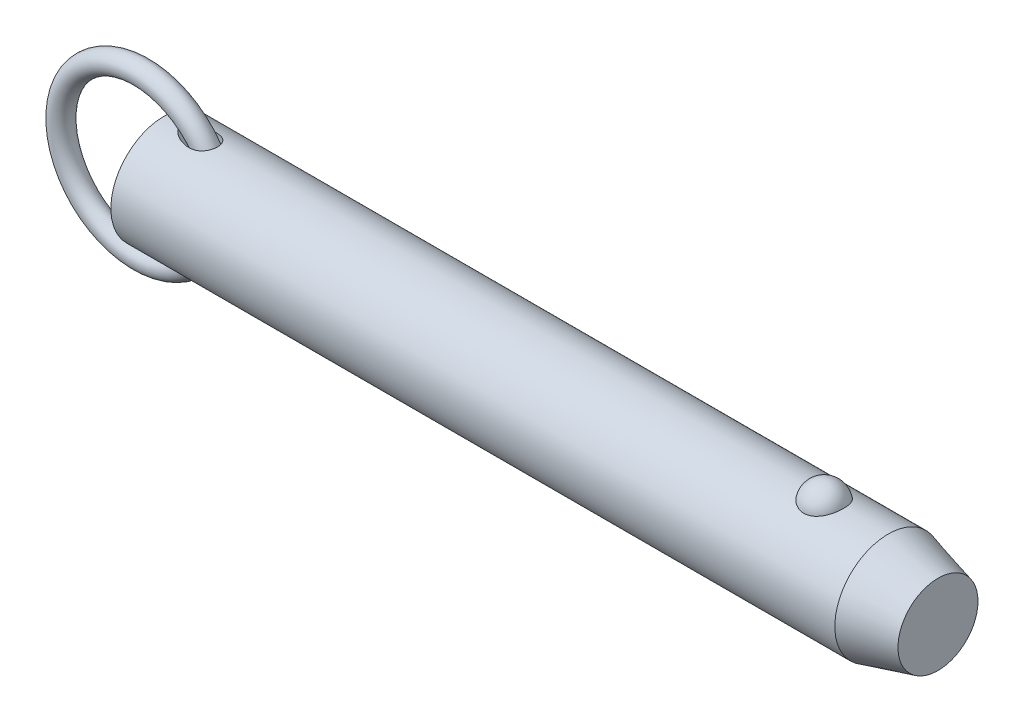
ISO-10303-21;
HEADER;
FILE_DESCRIPTION(('STEP AP214'),'2;1');
FILE_NAME('part.step','',(''),(''),'','','');
FILE_SCHEMA(('AUTOMOTIVE_DESIGN { 1 0 10303 214 1 1 1 1 }'));
ENDSEC;
DATA;
#1=APPLICATION_CONTEXT('core data for automotive mechanical design processes');
#2=APPLICATION_PROTOCOL_DEFINITION('international standard','automotive_design',2000,#1);
#3=PRODUCT_CONTEXT('',#1,'mechanical');
#4=PRODUCT('Part','Part','',(#3));
#5=PRODUCT_RELATED_PRODUCT_CATEGORY('part','',(#4));
#6=PRODUCT_DEFINITION_FORMATION('','',#4);
#7=PRODUCT_DEFINITION_CONTEXT('part definition',#1,'design');
#8=PRODUCT_DEFINITION('design','',#6,#7);
#9=PRODUCT_DEFINITION_SHAPE('','',#8);
#10=(LENGTH_UNIT() NAMED_UNIT(*) SI_UNIT(.MILLI.,.METRE.));
#11=(NAMED_UNIT(*) PLANE_ANGLE_UNIT() SI_UNIT($,.RADIAN.));
#12=(NAMED_UNIT(*) SI_UNIT($,.STERADIAN.) SOLID_ANGLE_UNIT());
#13=UNCERTAINTY_MEASURE_WITH_UNIT(LENGTH_MEASURE(1.E-05),#10,'distance_accuracy_value','');
#14=(GEOMETRIC_REPRESENTATION_CONTEXT(3) GLOBAL_UNCERTAINTY_ASSIGNED_CONTEXT((#13)) GLOBAL_UNIT_ASSIGNED_CONTEXT((#10,
#11,#12)) REPRESENTATION_CONTEXT('',''));
#15=CARTESIAN_POINT('',(0.,0.,0.));
#16=DIRECTION('',(0.,0.,1.));
#17=DIRECTION('',(1.,0.,0.));
#18=AXIS2_PLACEMENT_3D('',#15,#16,#17);
#19=CARTESIAN_POINT('',(-5.53898640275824,0.,0.));
#20=DIRECTION('',(0.,0.,1.));
#21=DIRECTION('',(1.,0.,0.));
#22=AXIS2_PLACEMENT_3D('',#19,#20,#21);
#23=TOROIDAL_SURFACE('',#22,19.05,2.54);
#24=CARTESIAN_POINT('',(16.0510135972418,0.,0.));
#25=VERTEX_POINT('',#24);
#26=VERTEX_LOOP('',#25);
#27=FACE_BOUND('',#26,.T.);
#28=ADVANCED_FACE('P0_F12',(#27),#23,.T.);
#29=CLOSED_SHELL('',(#28));
#30=MANIFOLD_SOLID_BREP('P0_B1',#29);
#31=CARTESIAN_POINT('',(0.,0.,0.));
#32=DIRECTION('',(1.,0.,0.));
#33=DIRECTION('',(0.,0.,-1.));
#34=AXIS2_PLACEMENT_3D('',#31,#32,#33);
#35=CYLINDRICAL_SURFACE('',#34,12.7);
#36=CARTESIAN_POINT('',(172.300738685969,0.,0.));
#37=DIRECTION('',(1.,0.,0.));
#38=DIRECTION('',(0.,0.,-1.));
#39=AXIS2_PLACEMENT_3D('',#36,#37,#38);
#40=CIRCLE('',#39,12.7);
#41=CARTESIAN_POINT('',(172.300738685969,0.,-12.7));
#42=VERTEX_POINT('',#41);
#43=EDGE_CURVE('P1_E89',#42,#42,#40,.T.);
#44=ORIENTED_EDGE('',*,*,#43,.F.);
#45=EDGE_LOOP('',(#44));
#46=FACE_BOUND('',#45,.T.);
#47=CARTESIAN_POINT('',(0.,0.,0.));
#48=DIRECTION('',(1.,0.,0.));
#49=DIRECTION('',(0.,0.,-1.));
#50=AXIS2_PLACEMENT_3D('',#47,#48,#49);
#51=CIRCLE('',#50,12.7);
#52=CARTESIAN_POINT('',(0.,0.,-12.7));
#53=VERTEX_POINT('',#52);
#54=EDGE_CURVE('P1_E52',#53,#53,#51,.T.);
#55=ORIENTED_EDGE('',*,*,#54,.T.);
#56=EDGE_LOOP('',(#55));
#57=FACE_BOUND('',#56,.T.);
#58=CARTESIAN_POINT('',(157.060042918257,11.7500437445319,4.81938502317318));
#59=CARTESIAN_POINT('',(156.935088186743,11.7500430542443,4.81938571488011));
#60=CARTESIAN_POINT('',(156.810144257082,11.7520975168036,4.81438658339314));
#61=CARTESIAN_POINT('',(156.561142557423,11.760253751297,4.79442904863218));
#62=CARTESIAN_POINT('',(156.437085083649,11.7663568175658,4.77946746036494));
#63=CARTESIAN_POINT('',(156.190901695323,11.7824262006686,4.7397141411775));
#64=CARTESIAN_POINT('',(156.068774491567,11.7923898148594,4.71492928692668));
#65=CARTESIAN_POINT('',(155.827187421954,11.8158938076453,4.65571340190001));
#66=CARTESIAN_POINT('',(155.70772859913,11.8294355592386,4.6212786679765));
#67=CARTESIAN_POINT('',(155.472557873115,11.8596812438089,4.54309502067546));
#68=CARTESIAN_POINT('',(155.356839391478,11.8763792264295,4.49936361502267));
#69=CARTESIAN_POINT('',(155.129653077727,11.9124878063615,4.40287235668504));
#70=CARTESIAN_POINT('',(155.018186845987,11.9318994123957,4.35010914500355));
#71=CARTESIAN_POINT('',(154.691278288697,11.9934256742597,4.17881316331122));
#72=CARTESIAN_POINT('',(154.483127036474,12.038858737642,4.04720756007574));
#73=CARTESIAN_POINT('',(154.085850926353,12.1352173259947,3.748564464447));
#74=CARTESIAN_POINT('',(153.897443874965,12.1862630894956,3.58061821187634));
#75=CARTESIAN_POINT('',(153.550521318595,12.2875163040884,3.21600758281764));
#76=CARTESIAN_POINT('',(153.392011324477,12.3377235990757,3.0193379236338));
#77=CARTESIAN_POINT('',(153.10168878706,12.4344923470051,2.592916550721));
#78=CARTESIAN_POINT('',(152.971376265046,12.4807925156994,2.36208286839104));
#79=CARTESIAN_POINT('',(152.749407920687,12.5623454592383,1.88070399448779));
#80=CARTESIAN_POINT('',(152.657755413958,12.5975972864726,1.63015711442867));
#81=CARTESIAN_POINT('',(152.514046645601,12.6538414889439,1.1129886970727));
#82=CARTESIAN_POINT('',(152.462499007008,12.6746503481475,0.846205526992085));
#83=CARTESIAN_POINT('',(152.401977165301,12.699153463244,0.307085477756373));
#84=CARTESIAN_POINT('',(152.393001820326,12.7028481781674,0.0347487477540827));
#85=CARTESIAN_POINT('',(152.417731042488,12.6927785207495,-0.506073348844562));
#86=CARTESIAN_POINT('',(152.451189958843,12.6791146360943,-0.774571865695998));
#87=CARTESIAN_POINT('',(152.559687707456,12.635882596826,-1.30170246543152));
#88=CARTESIAN_POINT('',(152.63472729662,12.606314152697,-1.56033436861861));
#89=CARTESIAN_POINT('',(152.82500006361,12.5342328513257,-2.0608389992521));
#90=CARTESIAN_POINT('',(152.940287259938,12.4917026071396,-2.30268867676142));
#91=CARTESIAN_POINT('',(153.208704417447,12.3981123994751,-2.76259600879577));
#92=CARTESIAN_POINT('',(153.361837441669,12.3470517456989,-2.98065173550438));
#93=CARTESIAN_POINT('',(153.703507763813,12.2416045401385,-3.38786328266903));
#94=CARTESIAN_POINT('',(153.892201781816,12.1872040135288,-3.57688418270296));
#95=CARTESIAN_POINT('',(154.300239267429,12.0814086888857,-3.91941073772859));
#96=CARTESIAN_POINT('',(154.519580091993,12.0300136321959,-4.07291945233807));
#97=CARTESIAN_POINT('',(154.978375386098,11.9373542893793,-4.33691289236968));
#98=CARTESIAN_POINT('',(155.217304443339,11.8958982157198,-4.44824125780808));
#99=CARTESIAN_POINT('',(155.71243761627,11.8268116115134,-4.62881985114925));
#100=CARTESIAN_POINT('',(155.968635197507,11.7991758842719,-4.69808589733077));
#101=CARTESIAN_POINT('',(156.477164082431,11.7622209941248,-4.78983181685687));
#102=CARTESIAN_POINT('',(156.729041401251,11.7520502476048,-4.81449025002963));
#103=CARTESIAN_POINT('',(157.233573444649,11.7485796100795,-4.82295735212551));
#104=CARTESIAN_POINT('',(157.486228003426,11.7552763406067,-4.80677420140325));
#105=CARTESIAN_POINT('',(157.976834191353,11.7842584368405,-4.73525430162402));
#106=CARTESIAN_POINT('',(158.214998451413,11.8060486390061,-4.68116061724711));
#107=CARTESIAN_POINT('',(158.678489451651,11.8622750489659,-4.53678133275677));
#108=CARTESIAN_POINT('',(158.903815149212,11.8967122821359,-4.44649279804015));
#109=CARTESIAN_POINT('',(159.340801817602,11.9754603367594,-4.2298761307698));
#110=CARTESIAN_POINT('',(159.552057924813,12.0199699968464,-4.10280539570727));
#111=CARTESIAN_POINT('',(159.950601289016,12.1138028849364,-3.81685409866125));
#112=CARTESIAN_POINT('',(160.137883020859,12.163127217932,-3.65796622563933));
#113=CARTESIAN_POINT('',(160.493350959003,12.2642343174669,-3.30364864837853));
#114=CARTESIAN_POINT('',(160.660111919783,12.3160165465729,-3.10678783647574));
#115=CARTESIAN_POINT('',(160.959579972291,12.4142566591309,-2.68748409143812));
#116=CARTESIAN_POINT('',(161.092280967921,12.4607135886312,-2.4650365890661));
#117=CARTESIAN_POINT('',(161.324691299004,12.5450236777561,-1.9928951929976));
#118=CARTESIAN_POINT('',(161.423215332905,12.5825557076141,-1.74255918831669));
#119=CARTESIAN_POINT('',(161.579227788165,12.6431720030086,-1.22773734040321));
#120=CARTESIAN_POINT('',(161.636715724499,12.6662560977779,-0.963251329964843));
#121=CARTESIAN_POINT('',(161.709544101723,12.6956486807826,-0.427355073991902));
#122=CARTESIAN_POINT('',(161.724837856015,12.7019385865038,-0.155937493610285));
#123=CARTESIAN_POINT('',(161.712779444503,12.6970201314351,0.38592890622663));
#124=CARTESIAN_POINT('',(161.68542805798,12.6858120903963,0.656377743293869));
#125=CARTESIAN_POINT('',(161.613060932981,12.6568455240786,1.05454017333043));
#126=CARTESIAN_POINT('',(161.583796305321,12.6451962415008,1.18577850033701));
#127=CARTESIAN_POINT('',(161.515022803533,12.6181819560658,1.44513808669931));
#128=CARTESIAN_POINT('',(161.475517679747,12.6028183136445,1.57326046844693));
#129=CARTESIAN_POINT('',(161.386439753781,12.5687547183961,1.82554978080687));
#130=CARTESIAN_POINT('',(161.336862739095,12.5500533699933,1.94971503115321));
#131=CARTESIAN_POINT('',(161.22792115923,12.5098093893,2.19314370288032));
#132=CARTESIAN_POINT('',(161.168560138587,12.4882677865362,2.31240887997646));
#133=CARTESIAN_POINT('',(161.03997128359,12.4427679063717,2.5459303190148));
#134=CARTESIAN_POINT('',(160.970688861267,12.4187964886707,2.66015396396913));
#135=CARTESIAN_POINT('',(160.822903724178,12.3691892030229,2.88202659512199));
#136=CARTESIAN_POINT('',(160.744404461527,12.3435539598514,2.98967802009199));
#137=CARTESIAN_POINT('',(160.578550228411,12.2912955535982,3.19774385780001));
#138=CARTESIAN_POINT('',(160.491191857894,12.2646720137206,3.29815546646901));
#139=CARTESIAN_POINT('',(160.308161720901,12.2111945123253,3.49095035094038));
#140=CARTESIAN_POINT('',(160.212493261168,12.1843406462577,3.58333679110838));
#141=CARTESIAN_POINT('',(160.013627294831,12.1312249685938,3.75922876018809));
#142=CARTESIAN_POINT('',(159.910450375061,12.104961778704,3.84275713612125));
#143=CARTESIAN_POINT('',(159.69701336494,12.0537284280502,4.00056406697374));
#144=CARTESIAN_POINT('',(159.586756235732,12.028757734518,4.07484645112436));
#145=CARTESIAN_POINT('',(159.359755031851,11.9808306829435,4.21367959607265));
#146=CARTESIAN_POINT('',(159.243006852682,11.9578756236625,4.27822410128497));
#147=CARTESIAN_POINT('',(159.00394258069,11.9147184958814,4.39698483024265));
#148=CARTESIAN_POINT('',(158.881628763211,11.894515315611,4.45120522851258));
#149=CARTESIAN_POINT('',(158.622952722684,11.8561129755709,4.55255353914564));
#150=CARTESIAN_POINT('',(158.486223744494,11.8381764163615,4.59884858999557));
#151=CARTESIAN_POINT('',(158.208608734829,11.8069093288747,4.67853897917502));
#152=CARTESIAN_POINT('',(158.067724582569,11.7935767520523,4.71194005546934));
#153=CARTESIAN_POINT('',(157.78309446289,11.7720277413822,4.76552188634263));
#154=CARTESIAN_POINT('',(157.639348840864,11.7638106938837,4.78570422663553));
#155=CARTESIAN_POINT('',(157.350411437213,11.7528195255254,4.81263433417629));
#156=CARTESIAN_POINT('',(157.205219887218,11.7500445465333,4.81938421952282));
#157=CARTESIAN_POINT('',(157.060042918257,11.7500437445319,4.81938502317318));
#158=B_SPLINE_CURVE_WITH_KNOTS('',3,(#58,#59,#60,#61,#62,#63,#64,#65,#66,#67,#68,#69,#70,#71,
#72,#73,#74,#75,#76,#77,#78,#79,#80,#81,#82,#83,#84,#85,#86,#87,#88,#89,#90,#91,#92,#93,#94,#95,
#96,#97,#98,#99,#100,#101,#102,#103,#104,#105,#106,#107,#108,#109,#110,#111,#112,#113,#114,#115,
#116,#117,#118,#119,#120,#121,#122,#123,#124,#125,#126,#127,#128,#129,#130,#131,#132,#133,#134,
#135,#136,#137,#138,#139,#140,#141,#142,#143,#144,#145,#146,#147,#148,#149,#150,#151,#152,#153,
#154,#155,#156,#157),.UNSPECIFIED.,.T.,.F.,(4,2,2,2,2,2,2,2,2,2,2,2,2,2,2,2,2,2,2,2,2,2,2,2,2,2,
2,2,2,2,2,2,2,2,2,2,2,2,2,2,2,2,2,2,2,2,2,2,2,4),(0.,0.374729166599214,0.749578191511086,
1.12416526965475,1.49889629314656,1.87292776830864,2.24709865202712,2.99481328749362,
3.76399449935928,4.53331735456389,5.3368391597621,6.14042986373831,6.95405296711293,
7.76765424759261,8.57656703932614,9.38549455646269,10.1955119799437,11.0055949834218,
11.8193353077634,12.6330054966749,13.4294141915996,14.2255231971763,14.9815786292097,
15.7374826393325,16.4696948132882,17.2019663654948,17.9501979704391,18.6986017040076,
19.4844704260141,20.2704797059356,21.0815215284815,21.8925729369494,22.7045213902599,
23.5164550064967,23.9209608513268,24.3253187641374,24.7298461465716,25.1342272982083,
25.54092555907,25.9474719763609,26.3541750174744,26.7607169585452,27.166183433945,
27.5714814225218,27.9770386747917,28.3824315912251,28.8181206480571,29.2536155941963,
29.6890582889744,30.1244323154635),.UNSPECIFIED.);
#159=CARTESIAN_POINT('',(157.060042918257,11.7500437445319,4.81938502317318));
#160=VERTEX_POINT('',#159);
#161=EDGE_CURVE('P1_E80',#160,#160,#158,.T.);
#162=ORIENTED_EDGE('',*,*,#161,.T.);
#163=EDGE_LOOP('',(#162));
#164=FACE_BOUND('',#163,.T.);
#165=CARTESIAN_POINT('',(-5.53898640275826,0.,0.));
#166=DIRECTION('',(0.796400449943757,-0.604769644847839,0.));
#167=DIRECTION('',(0.604769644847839,0.796400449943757,0.));
#168=AXIS2_PLACEMENT_3D('',#165,#166,#167);
#169=ELLIPSE('',#168,15.9467514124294,12.7);
#170=CARTESIAN_POINT('',(4.09482149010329,12.6864319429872,0.586893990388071));
#171=VERTEX_POINT('',#170);
#172=CARTESIAN_POINT('',(4.09482149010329,12.6864319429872,-0.586893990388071));
#173=VERTEX_POINT('',#172);
#174=EDGE_CURVE('P1_E47',#171,#173,#169,.F.);
#175=ORIENTED_EDGE('',*,*,#174,.T.);
#176=CARTESIAN_POINT('',(4.06153170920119,12.6905758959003,-0.48916605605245));
#177=CARTESIAN_POINT('',(4.0811137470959,12.6881366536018,-0.552489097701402));
#178=CARTESIAN_POINT('',(4.1041785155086,12.6852663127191,-0.614604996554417));
#179=CARTESIAN_POINT('',(4.15628434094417,12.6787965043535,-0.736067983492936));
#180=CARTESIAN_POINT('',(4.18531032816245,12.6751988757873,-0.795421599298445));
#181=CARTESIAN_POINT('',(4.27911159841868,12.6636052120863,-0.967590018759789));
#182=CARTESIAN_POINT('',(4.35123408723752,12.654730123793,-1.07635920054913));
#183=CARTESIAN_POINT('',(4.49106800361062,12.6376715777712,-1.25922957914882));
#184=CARTESIAN_POINT('',(4.55601066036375,12.6297947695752,-1.33556751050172));
#185=CARTESIAN_POINT('',(4.692236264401,12.6134116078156,-1.4823274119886));
#186=CARTESIAN_POINT('',(4.76352147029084,12.6049050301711,-1.55274725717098));
#187=CARTESIAN_POINT('',(4.91163946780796,12.587417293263,-1.68868704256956));
#188=CARTESIAN_POINT('',(4.98851399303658,12.5784327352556,-1.75416062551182));
#189=CARTESIAN_POINT('',(5.14630057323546,12.560235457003,-1.88003275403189));
#190=CARTESIAN_POINT('',(5.22721398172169,12.5510226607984,-1.94042957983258));
#191=CARTESIAN_POINT('',(5.45368877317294,12.5256514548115,-2.09966332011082));
#192=CARTESIAN_POINT('',(5.60261616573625,12.5094182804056,-2.19371988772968));
#193=CARTESIAN_POINT('',(5.90795545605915,12.4774211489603,-2.36893890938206));
#194=CARTESIAN_POINT('',(6.0643723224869,12.4616575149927,-2.45009264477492));
#195=CARTESIAN_POINT('',(6.38306132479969,12.431227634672,-2.6000824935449));
#196=CARTESIAN_POINT('',(6.54533237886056,12.4165611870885,-2.66892086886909));
#197=CARTESIAN_POINT('',(6.87462618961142,12.3889351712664,-2.79435199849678));
#198=CARTESIAN_POINT('',(7.04164773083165,12.3759751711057,-2.85094785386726));
#199=CARTESIAN_POINT('',(7.38726647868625,12.3518460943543,-2.95377962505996));
#200=CARTESIAN_POINT('',(7.56604577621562,12.3407843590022,-2.99943209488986));
#201=CARTESIAN_POINT('',(7.92698692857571,12.3219309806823,-3.07596683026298));
#202=CARTESIAN_POINT('',(8.10914972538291,12.314140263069,-3.10684491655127));
#203=CARTESIAN_POINT('',(8.47511457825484,12.3025918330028,-3.15226850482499));
#204=CARTESIAN_POINT('',(8.6589097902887,12.2988216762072,-3.16686440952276));
#205=CARTESIAN_POINT('',(9.02696087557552,12.2959421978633,-3.17802250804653));
#206=CARTESIAN_POINT('',(9.21121628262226,12.2968292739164,-3.17459864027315));
#207=CARTESIAN_POINT('',(9.61636263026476,12.3045198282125,-3.14471110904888));
#208=CARTESIAN_POINT('',(9.83695552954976,12.3125080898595,-3.11363232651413));
#209=CARTESIAN_POINT('',(10.1619126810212,12.3303028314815,-3.04206574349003));
#210=CARTESIAN_POINT('',(10.2692747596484,12.3372061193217,-3.01403983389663));
#211=CARTESIAN_POINT('',(10.4811758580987,12.3528538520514,-2.94925947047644));
#212=CARTESIAN_POINT('',(10.5857162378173,12.361597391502,-2.91250930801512));
#213=CARTESIAN_POINT('',(10.792132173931,12.3808585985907,-2.8295174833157));
#214=CARTESIAN_POINT('',(10.8939665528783,12.3913944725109,-2.78317723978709));
#215=CARTESIAN_POINT('',(11.092611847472,12.4138762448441,-2.68112002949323));
#216=CARTESIAN_POINT('',(11.1894254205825,12.4258213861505,-2.62540809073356));
#217=CARTESIAN_POINT('',(11.3768740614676,12.4507225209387,-2.50465655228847));
#218=CARTESIAN_POINT('',(11.4675115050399,12.4636781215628,-2.43962056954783));
#219=CARTESIAN_POINT('',(11.6414572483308,12.4901070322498,-2.30048560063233));
#220=CARTESIAN_POINT('',(11.7247669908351,12.5035802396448,-2.22638840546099));
#221=CARTESIAN_POINT('',(11.8713131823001,12.5285000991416,-2.08117367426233));
#222=CARTESIAN_POINT('',(11.9357009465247,12.5399538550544,-2.01121596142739));
#223=CARTESIAN_POINT('',(12.0576805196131,12.5624496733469,-1.86555293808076));
#224=CARTESIAN_POINT('',(12.1152732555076,12.5734917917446,-1.7898484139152));
#225=CARTESIAN_POINT('',(12.223073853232,12.5947858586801,-1.63327883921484));
#226=CARTESIAN_POINT('',(12.2732844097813,12.6050380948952,-1.5524156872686));
#227=CARTESIAN_POINT('',(12.3658430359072,12.6243983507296,-1.38621267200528));
#228=CARTESIAN_POINT('',(12.408191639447,12.6335064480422,-1.30087311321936));
#229=CARTESIAN_POINT('',(12.5150098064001,12.6569076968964,-1.05702619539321));
#230=CARTESIAN_POINT('',(12.5703399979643,12.6695746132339,-0.894232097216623));
#231=CARTESIAN_POINT('',(12.6526225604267,12.6886816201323,-0.561391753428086));
#232=CARTESIAN_POINT('',(12.6795825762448,12.6951233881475,-0.391347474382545));
#233=CARTESIAN_POINT('',(12.7041016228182,12.7009766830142,-0.0537636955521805));
#234=CARTESIAN_POINT('',(12.7024538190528,12.7005778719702,0.113714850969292));
#235=CARTESIAN_POINT('',(12.6717240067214,12.6932548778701,0.445979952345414));
#236=CARTESIAN_POINT('',(12.6426435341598,12.6863310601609,0.610766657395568));
#237=CARTESIAN_POINT('',(12.5579769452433,12.6667465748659,0.932429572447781));
#238=CARTESIAN_POINT('',(12.5024793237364,12.6541050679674,1.08933027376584));
#239=CARTESIAN_POINT('',(12.3665691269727,12.6244558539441,1.39146752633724));
#240=CARTESIAN_POINT('',(12.2861577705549,12.6074483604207,1.53670464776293));
#241=CARTESIAN_POINT('',(12.1018203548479,12.5706804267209,1.81319588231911));
#242=CARTESIAN_POINT('',(11.9976588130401,12.5508932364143,1.94428915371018));
#243=CARTESIAN_POINT('',(11.7695265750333,12.5107540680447,2.18776051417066));
#244=CARTESIAN_POINT('',(11.6455540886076,12.4904020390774,2.3001369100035));
#245=CARTESIAN_POINT('',(11.3759347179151,12.4502278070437,2.50870972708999));
#246=CARTESIAN_POINT('',(11.2295880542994,12.4304654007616,2.60400962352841));
#247=CARTESIAN_POINT('',(10.9239803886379,12.3941696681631,2.77162929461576));
#248=CARTESIAN_POINT('',(10.7647152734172,12.3776373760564,2.84394171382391));
#249=CARTESIAN_POINT('',(10.4192039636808,12.3473062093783,2.97303525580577));
#250=CARTESIAN_POINT('',(10.2319332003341,12.3340204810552,3.027171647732));
#251=CARTESIAN_POINT('',(9.85152982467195,12.3134301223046,3.10986173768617));
#252=CARTESIAN_POINT('',(9.65839336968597,12.3061295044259,3.13839827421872));
#253=CARTESIAN_POINT('',(9.31022514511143,12.2982822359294,3.16897517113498));
#254=CARTESIAN_POINT('',(9.15555718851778,12.2966525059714,3.17526894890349));
#255=CARTESIAN_POINT('',(8.84618945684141,12.2967963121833,3.17471335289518));
#256=CARTESIAN_POINT('',(8.6914897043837,12.2985715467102,3.16785742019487));
#257=CARTESIAN_POINT('',(8.38280471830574,12.3051648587,3.14214692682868));
#258=CARTESIAN_POINT('',(8.22882218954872,12.3099904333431,3.12326280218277));
#259=CARTESIAN_POINT('',(7.92276070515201,12.3222644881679,3.07448013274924));
#260=CARTESIAN_POINT('',(7.77068148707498,12.3297126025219,3.04458312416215));
#261=CARTESIAN_POINT('',(7.46452663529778,12.3470493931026,2.97350781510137));
#262=CARTESIAN_POINT('',(7.31052714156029,12.3570043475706,2.93201910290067));
#263=CARTESIAN_POINT('',(7.00579083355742,12.3787609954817,2.83876185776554));
#264=CARTESIAN_POINT('',(6.85505451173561,12.3905629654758,2.7869917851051));
#265=CARTESIAN_POINT('',(6.55781208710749,12.415528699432,2.67357744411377));
#266=CARTESIAN_POINT('',(6.41129783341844,12.4286895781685,2.61195394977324));
#267=CARTESIAN_POINT('',(6.12302950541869,12.4559398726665,2.47874512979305));
#268=CARTESIAN_POINT('',(5.98127390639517,12.4700289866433,2.40716303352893));
#269=CARTESIAN_POINT('',(5.67073126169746,12.5020754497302,2.23550426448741));
#270=CARTESIAN_POINT('',(5.50343839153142,12.5201625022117,2.13268685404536));
#271=CARTESIAN_POINT('',(5.26147616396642,12.5471537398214,1.96522579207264));
#272=CARTESIAN_POINT('',(5.18224299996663,12.5561365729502,1.90713440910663));
#273=CARTESIAN_POINT('',(5.0274647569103,12.5739122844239,1.78618989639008));
#274=CARTESIAN_POINT('',(4.95191912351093,12.5827051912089,1.72333748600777));
#275=CARTESIAN_POINT('',(4.81787163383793,12.598469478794,1.60360864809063));
#276=CARTESIAN_POINT('',(4.75865966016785,12.6054958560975,1.54753994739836));
#277=CARTESIAN_POINT('',(4.64406285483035,12.6191906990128,1.43158546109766));
#278=CARTESIAN_POINT('',(4.58867926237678,12.6258590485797,1.37169845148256));
#279=CARTESIAN_POINT('',(4.43014912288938,12.6450546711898,1.18656670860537));
#280=CARTESIAN_POINT('',(4.33372726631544,12.6568788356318,1.05507993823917));
#281=CARTESIAN_POINT('',(4.21252055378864,12.6718304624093,0.848052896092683));
#282=CARTESIAN_POINT('',(4.17660155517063,12.6762773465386,0.779100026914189));
#283=CARTESIAN_POINT('',(4.11264979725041,12.6842122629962,0.637080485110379));
#284=CARTESIAN_POINT('',(4.08466792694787,12.6876941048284,0.563990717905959));
#285=CARTESIAN_POINT('',(4.06153170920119,12.6905758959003,0.489166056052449));
#286=B_SPLINE_CURVE_WITH_KNOTS('',3,(#176,#177,#178,#179,#180,#181,#182,#183,#184,#185,#186,
#187,#188,#189,#190,#191,#192,#193,#194,#195,#196,#197,#198,#199,#200,#201,#202,#203,#204,#205,
#206,#207,#208,#209,#210,#211,#212,#213,#214,#215,#216,#217,#218,#219,#220,#221,#222,#223,#224,
#225,#226,#227,#228,#229,#230,#231,#232,#233,#234,#235,#236,#237,#238,#239,#240,#241,#242,#243,
#244,#245,#246,#247,#248,#249,#250,#251,#252,#253,#254,#255,#256,#257,#258,#259,#260,#261,#262,
#263,#264,#265,#266,#267,#268,#269,#270,#271,#272,#273,#274,#275,#276,#277,#278,#279,#280,#281,
#282,#283,#284,#285),.UNSPECIFIED.,.F.,.F.,(4,2,2,2,2,2,2,2,2,2,2,2,2,2,2,2,2,2,2,2,2,2,2,2,2,2,
2,2,2,2,2,2,2,2,2,2,2,2,2,2,2,2,2,2,2,2,2,2,2,2,2,2,2,2,4),(0.,0.198708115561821,
0.39691995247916,0.787580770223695,1.08882492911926,1.3901767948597,1.69407136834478,
1.9980684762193,2.52793143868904,3.05815092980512,3.58827293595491,4.1182605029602,
4.67218806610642,5.22627222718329,5.77863637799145,6.33057333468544,6.99657211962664,
7.32977411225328,7.66281254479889,7.99946156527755,8.33593054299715,8.6722693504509,
9.00854178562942,9.29544181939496,9.58230266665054,9.8690585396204,10.155794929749,
10.670233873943,11.184534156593,11.6845985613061,12.1846349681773,12.6830079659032,
13.1813565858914,13.6848795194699,14.1884479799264,14.7135333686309,15.2387866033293,
15.8228373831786,16.4072794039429,16.8710810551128,17.3351141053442,17.8002921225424,
18.2654052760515,18.7444169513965,19.2235004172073,19.7015868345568,20.1795185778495,
20.7699825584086,21.0658110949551,21.361595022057,21.6069574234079,21.8523988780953,
22.3397467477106,22.5729183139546,22.8075527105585),.UNSPECIFIED.);
#287=EDGE_CURVE('P1_E51',#173,#171,#286,.T.);
#288=ORIENTED_EDGE('',*,*,#287,.T.);
#289=EDGE_LOOP('',(#175,#288));
#290=FACE_BOUND('',#289,.T.);
#291=CARTESIAN_POINT('',(-5.53898640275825,0.,0.));
#292=DIRECTION('',(-0.796400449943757,-0.604769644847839,0.));
#293=DIRECTION('',(0.604769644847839,-0.796400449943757,0.));
#294=AXIS2_PLACEMENT_3D('',#291,#292,#293);
#295=ELLIPSE('',#294,15.9467514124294,12.7);
#296=CARTESIAN_POINT('',(4.0948214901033,-12.6864319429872,0.586893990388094));
#297=VERTEX_POINT('',#296);
#298=CARTESIAN_POINT('',(4.0948214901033,-12.6864319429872,-0.586893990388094));
#299=VERTEX_POINT('',#298);
#300=EDGE_CURVE('P1_E28',#297,#299,#295,.F.);
#301=ORIENTED_EDGE('',*,*,#300,.F.);
#302=CARTESIAN_POINT('',(4.06153170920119,-12.6905758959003,0.489166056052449));
#303=CARTESIAN_POINT('',(4.08111374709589,-12.6881366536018,0.552489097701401));
#304=CARTESIAN_POINT('',(4.1041785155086,-12.6852663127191,0.614604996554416));
#305=CARTESIAN_POINT('',(4.15628434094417,-12.6787965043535,0.736067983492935));
#306=CARTESIAN_POINT('',(4.18531032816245,-12.6751988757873,0.795421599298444));
#307=CARTESIAN_POINT('',(4.27911159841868,-12.6636052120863,0.967590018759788));
#308=CARTESIAN_POINT('',(4.35123408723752,-12.654730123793,1.07635920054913));
#309=CARTESIAN_POINT('',(4.49106800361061,-12.6376715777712,1.25922957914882));
#310=CARTESIAN_POINT('',(4.55601066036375,-12.6297947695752,1.33556751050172));
#311=CARTESIAN_POINT('',(4.692236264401,-12.6134116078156,1.48232741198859));
#312=CARTESIAN_POINT('',(4.76352147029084,-12.6049050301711,1.55274725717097));
#313=CARTESIAN_POINT('',(4.91163946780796,-12.587417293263,1.68868704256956));
#314=CARTESIAN_POINT('',(4.98851399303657,-12.5784327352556,1.75416062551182));
#315=CARTESIAN_POINT('',(5.14630057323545,-12.560235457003,1.88003275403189));
#316=CARTESIAN_POINT('',(5.22721398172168,-12.5510226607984,1.94042957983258));
#317=CARTESIAN_POINT('',(5.45368877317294,-12.5256514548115,2.09966332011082));
#318=CARTESIAN_POINT('',(5.60261616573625,-12.5094182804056,2.19371988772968));
#319=CARTESIAN_POINT('',(5.90795545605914,-12.4774211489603,2.36893890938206));
#320=CARTESIAN_POINT('',(6.06437232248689,-12.4616575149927,2.45009264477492));
#321=CARTESIAN_POINT('',(6.38306132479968,-12.431227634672,2.6000824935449));
#322=CARTESIAN_POINT('',(6.54533237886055,-12.4165611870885,2.66892086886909));
#323=CARTESIAN_POINT('',(6.87462618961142,-12.3889351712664,2.79435199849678));
#324=CARTESIAN_POINT('',(7.04164773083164,-12.3759751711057,2.85094785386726));
#325=CARTESIAN_POINT('',(7.38726647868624,-12.3518460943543,2.95377962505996));
#326=CARTESIAN_POINT('',(7.56604577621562,-12.3407843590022,2.99943209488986));
#327=CARTESIAN_POINT('',(7.92698692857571,-12.3219309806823,3.07596683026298));
#328=CARTESIAN_POINT('',(8.1091497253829,-12.314140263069,3.10684491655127));
#329=CARTESIAN_POINT('',(8.47511457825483,-12.3025918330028,3.15226850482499));
#330=CARTESIAN_POINT('',(8.65890979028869,-12.2988216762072,3.16686440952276));
#331=CARTESIAN_POINT('',(9.02696087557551,-12.2959421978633,3.17802250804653));
#332=CARTESIAN_POINT('',(9.21121628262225,-12.2968292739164,3.17459864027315));
#333=CARTESIAN_POINT('',(9.61636263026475,-12.3045198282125,3.14471110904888));
#334=CARTESIAN_POINT('',(9.83695552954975,-12.3125080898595,3.11363232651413));
#335=CARTESIAN_POINT('',(10.1619126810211,-12.3303028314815,3.04206574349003));
#336=CARTESIAN_POINT('',(10.2692747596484,-12.3372061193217,3.01403983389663));
#337=CARTESIAN_POINT('',(10.4811758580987,-12.3528538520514,2.94925947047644));
#338=CARTESIAN_POINT('',(10.5857162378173,-12.361597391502,2.91250930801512));
#339=CARTESIAN_POINT('',(10.792132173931,-12.3808585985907,2.8295174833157));
#340=CARTESIAN_POINT('',(10.8939665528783,-12.3913944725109,2.78317723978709));
#341=CARTESIAN_POINT('',(11.092611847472,-12.4138762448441,2.68112002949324));
#342=CARTESIAN_POINT('',(11.1894254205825,-12.4258213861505,2.62540809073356));
#343=CARTESIAN_POINT('',(11.3768740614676,-12.4507225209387,2.50465655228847));
#344=CARTESIAN_POINT('',(11.4675115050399,-12.4636781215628,2.43962056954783));
#345=CARTESIAN_POINT('',(11.6414572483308,-12.4901070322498,2.30048560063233));
#346=CARTESIAN_POINT('',(11.7247669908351,-12.5035802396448,2.22638840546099));
#347=CARTESIAN_POINT('',(11.8713131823,-12.5285000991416,2.08117367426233));
#348=CARTESIAN_POINT('',(11.9357009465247,-12.5399538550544,2.01121596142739));
#349=CARTESIAN_POINT('',(12.0576805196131,-12.5624496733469,1.86555293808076));
#350=CARTESIAN_POINT('',(12.1152732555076,-12.5734917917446,1.7898484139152));
#351=CARTESIAN_POINT('',(12.223073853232,-12.5947858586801,1.63327883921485));
#352=CARTESIAN_POINT('',(12.2732844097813,-12.6050380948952,1.5524156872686));
#353=CARTESIAN_POINT('',(12.3658430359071,-12.6243983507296,1.38621267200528));
#354=CARTESIAN_POINT('',(12.408191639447,-12.6335064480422,1.30087311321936));
#355=CARTESIAN_POINT('',(12.5150098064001,-12.6569076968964,1.05702619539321));
#356=CARTESIAN_POINT('',(12.5703399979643,-12.6695746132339,0.894232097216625));
#357=CARTESIAN_POINT('',(12.6526225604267,-12.6886816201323,0.56139175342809));
#358=CARTESIAN_POINT('',(12.6795825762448,-12.6951233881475,0.39134747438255));
#359=CARTESIAN_POINT('',(12.7041016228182,-12.7009766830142,0.0537636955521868));
#360=CARTESIAN_POINT('',(12.7024538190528,-12.7005778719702,-0.113714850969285));
#361=CARTESIAN_POINT('',(12.6717240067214,-12.6932548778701,-0.445979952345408));
#362=CARTESIAN_POINT('',(12.6426435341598,-12.6863310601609,-0.610766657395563));
#363=CARTESIAN_POINT('',(12.5579769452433,-12.6667465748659,-0.932429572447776));
#364=CARTESIAN_POINT('',(12.5024793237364,-12.6541050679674,-1.08933027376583));
#365=CARTESIAN_POINT('',(12.3665691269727,-12.6244558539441,-1.39146752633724));
#366=CARTESIAN_POINT('',(12.2861577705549,-12.6074483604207,-1.53670464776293));
#367=CARTESIAN_POINT('',(12.1018203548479,-12.5706804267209,-1.81319588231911));
#368=CARTESIAN_POINT('',(11.9976588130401,-12.5508932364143,-1.94428915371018));
#369=CARTESIAN_POINT('',(11.7695265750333,-12.5107540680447,-2.18776051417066));
#370=CARTESIAN_POINT('',(11.6455540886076,-12.4904020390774,-2.3001369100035));
#371=CARTESIAN_POINT('',(11.3759347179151,-12.4502278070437,-2.50870972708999));
#372=CARTESIAN_POINT('',(11.2295880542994,-12.4304654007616,-2.60400962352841));
#373=CARTESIAN_POINT('',(10.9239803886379,-12.3941696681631,-2.77162929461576));
#374=CARTESIAN_POINT('',(10.7647152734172,-12.3776373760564,-2.84394171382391));
#375=CARTESIAN_POINT('',(10.4192039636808,-12.3473062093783,-2.97303525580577));
#376=CARTESIAN_POINT('',(10.2319332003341,-12.3340204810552,-3.027171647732));
#377=CARTESIAN_POINT('',(9.85152982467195,-12.3134301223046,-3.10986173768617));
#378=CARTESIAN_POINT('',(9.65839336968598,-12.3061295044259,-3.13839827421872));
#379=CARTESIAN_POINT('',(9.31022514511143,-12.2982822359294,-3.16897517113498));
#380=CARTESIAN_POINT('',(9.15555718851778,-12.2966525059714,-3.17526894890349));
#381=CARTESIAN_POINT('',(8.84618945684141,-12.2967963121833,-3.17471335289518));
#382=CARTESIAN_POINT('',(8.6914897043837,-12.2985715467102,-3.16785742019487));
#383=CARTESIAN_POINT('',(8.38280471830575,-12.3051648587,-3.14214692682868));
#384=CARTESIAN_POINT('',(8.22882218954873,-12.3099904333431,-3.12326280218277));
#385=CARTESIAN_POINT('',(7.92276070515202,-12.3222644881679,-3.07448013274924));
#386=CARTESIAN_POINT('',(7.77068148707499,-12.3297126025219,-3.04458312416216));
#387=CARTESIAN_POINT('',(7.46452663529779,-12.3470493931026,-2.97350781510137));
#388=CARTESIAN_POINT('',(7.3105271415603,-12.3570043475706,-2.93201910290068));
#389=CARTESIAN_POINT('',(7.00579083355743,-12.3787609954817,-2.83876185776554));
#390=CARTESIAN_POINT('',(6.85505451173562,-12.3905629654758,-2.78699178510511));
#391=CARTESIAN_POINT('',(6.5578120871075,-12.415528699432,-2.67357744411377));
#392=CARTESIAN_POINT('',(6.41129783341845,-12.4286895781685,-2.61195394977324));
#393=CARTESIAN_POINT('',(6.12302950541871,-12.4559398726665,-2.47874512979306));
#394=CARTESIAN_POINT('',(5.98127390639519,-12.4700289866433,-2.40716303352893));
#395=CARTESIAN_POINT('',(5.67073126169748,-12.5020754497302,-2.23550426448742));
#396=CARTESIAN_POINT('',(5.50343839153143,-12.5201625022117,-2.13268685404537));
#397=CARTESIAN_POINT('',(5.26147616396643,-12.5471537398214,-1.96522579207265));
#398=CARTESIAN_POINT('',(5.18224299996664,-12.5561365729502,-1.90713440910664));
#399=CARTESIAN_POINT('',(5.02746475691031,-12.5739122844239,-1.78618989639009));
#400=CARTESIAN_POINT('',(4.95191912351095,-12.5827051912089,-1.72333748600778));
#401=CARTESIAN_POINT('',(4.81787163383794,-12.598469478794,-1.60360864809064));
#402=CARTESIAN_POINT('',(4.75865966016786,-12.6054958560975,-1.54753994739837));
#403=CARTESIAN_POINT('',(4.64406285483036,-12.6191906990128,-1.43158546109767));
#404=CARTESIAN_POINT('',(4.58867926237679,-12.6258590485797,-1.37169845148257));
#405=CARTESIAN_POINT('',(4.43014912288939,-12.6450546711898,-1.18656670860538));
#406=CARTESIAN_POINT('',(4.33372726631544,-12.6568788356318,-1.05507993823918));
#407=CARTESIAN_POINT('',(4.21252055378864,-12.6718304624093,-0.848052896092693));
#408=CARTESIAN_POINT('',(4.17660155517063,-12.6762773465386,-0.779100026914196));
#409=CARTESIAN_POINT('',(4.11264979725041,-12.6842122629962,-0.637080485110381));
#410=CARTESIAN_POINT('',(4.08466792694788,-12.6876941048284,-0.563990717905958));
#411=CARTESIAN_POINT('',(4.0615317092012,-12.6905758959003,-0.489166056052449));
#412=B_SPLINE_CURVE_WITH_KNOTS('',3,(#302,#303,#304,#305,#306,#307,#308,#309,#310,#311,#312,
#313,#314,#315,#316,#317,#318,#319,#320,#321,#322,#323,#324,#325,#326,#327,#328,#329,#330,#331,
#332,#333,#334,#335,#336,#337,#338,#339,#340,#341,#342,#343,#344,#345,#346,#347,#348,#349,#350,
#351,#352,#353,#354,#355,#356,#357,#358,#359,#360,#361,#362,#363,#364,#365,#366,#367,#368,#369,
#370,#371,#372,#373,#374,#375,#376,#377,#378,#379,#380,#381,#382,#383,#384,#385,#386,#387,#388,
#389,#390,#391,#392,#393,#394,#395,#396,#397,#398,#399,#400,#401,#402,#403,#404,#405,#406,#407,
#408,#409,#410,#411),.UNSPECIFIED.,.F.,.F.,(4,2,2,2,2,2,2,2,2,2,2,2,2,2,2,2,2,2,2,2,2,2,2,2,2,2,
2,2,2,2,2,2,2,2,2,2,2,2,2,2,2,2,2,2,2,2,2,2,2,2,2,2,2,2,4),(0.,0.198708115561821,
0.39691995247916,0.787580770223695,1.08882492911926,1.3901767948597,1.69407136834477,
1.9980684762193,2.52793143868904,3.05815092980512,3.5882729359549,4.1182605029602,
4.67218806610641,5.22627222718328,5.77863637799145,6.33057333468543,6.99657211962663,
7.32977411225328,7.66281254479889,7.99946156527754,8.33593054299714,8.6722693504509,
9.00854178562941,9.29544181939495,9.58230266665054,9.8690585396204,10.155794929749,
10.670233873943,11.184534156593,11.6845985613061,12.1846349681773,12.6830079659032,
13.1813565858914,13.6848795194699,14.1884479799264,14.7135333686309,15.2387866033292,
15.8228373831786,16.4072794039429,16.8710810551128,17.3351141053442,17.8002921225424,
18.2654052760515,18.7444169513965,19.2235004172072,19.7015868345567,20.1795185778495,
20.7699825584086,21.0658110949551,21.361595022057,21.6069574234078,21.8523988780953,
22.3397467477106,22.5729183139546,22.8075527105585),.UNSPECIFIED.);
#413=EDGE_CURVE('P1_E10',#297,#299,#412,.T.);
#414=ORIENTED_EDGE('',*,*,#413,.T.);
#415=EDGE_LOOP('',(#301,#414));
#416=FACE_BOUND('',#415,.T.);
#417=ADVANCED_FACE('P1_F15',(#46,#57,#164,#290,#416),#35,.T.);
#418=CARTESIAN_POINT('',(0.,0.,0.));
#419=DIRECTION('',(-1.,0.,0.));
#420=DIRECTION('',(0.,0.,1.));
#421=AXIS2_PLACEMENT_3D('',#418,#419,#420);
#422=PLANE('',#421);
#423=ORIENTED_EDGE('',*,*,#54,.F.);
#424=EDGE_LOOP('',(#423));
#425=FACE_BOUND('',#424,.T.);
#426=ADVANCED_FACE('P1_F17',(#425),#422,.T.);
#427=CARTESIAN_POINT('',(184.15,0.,0.));
#428=DIRECTION('',(-1.,0.,0.));
#429=DIRECTION('',(0.,0.,1.));
#430=AXIS2_PLACEMENT_3D('',#427,#428,#429);
#431=CONICAL_SURFACE('',#430,9.52500000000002,0.26179938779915);
#432=ORIENTED_EDGE('',*,*,#43,.T.);
#433=EDGE_LOOP('',(#432));
#434=FACE_BOUND('',#433,.T.);
#435=CARTESIAN_POINT('',(184.15,0.,0.));
#436=DIRECTION('',(1.,0.,0.));
#437=DIRECTION('',(0.,0.,-1.));
#438=AXIS2_PLACEMENT_3D('',#435,#436,#437);
#439=CIRCLE('',#438,9.52500000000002);
#440=CARTESIAN_POINT('',(184.15,0.,-9.52500000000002));
#441=VERTEX_POINT('',#440);
#442=EDGE_CURVE('P1_E86',#441,#441,#439,.T.);
#443=ORIENTED_EDGE('',*,*,#442,.F.);
#444=EDGE_LOOP('',(#443));
#445=FACE_BOUND('',#444,.T.);
#446=ADVANCED_FACE('P1_F105',(#434,#445),#431,.T.);
#447=CARTESIAN_POINT('',(184.15,9.52500000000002,0.));
#448=DIRECTION('',(1.,0.,0.));
#449=DIRECTION('',(0.,0.,-1.));
#450=AXIS2_PLACEMENT_3D('',#447,#448,#449);
#451=PLANE('',#450);
#452=ORIENTED_EDGE('',*,*,#442,.T.);
#453=EDGE_LOOP('',(#452));
#454=FACE_BOUND('',#453,.T.);
#455=ADVANCED_FACE('P1_F78',(#454),#451,.T.);
#456=CARTESIAN_POINT('',(157.060042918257,11.43,0.));
#457=DIRECTION('',(-1.,0.,0.));
#458=DIRECTION('',(0.,-1.,0.));
#459=AXIS2_PLACEMENT_3D('',#456,#457,#458);
#460=SPHERICAL_SURFACE('',#459,4.83);
#461=ORIENTED_EDGE('',*,*,#161,.F.);
#462=EDGE_LOOP('',(#461));
#463=FACE_BOUND('',#462,.T.);
#464=ADVANCED_FACE('P1_F71',(#463),#460,.T.);
#465=CARTESIAN_POINT('',(-5.53898640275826,0.,0.));
#466=DIRECTION('',(0.,0.,1.));
#467=DIRECTION('',(1.,0.,0.));
#468=AXIS2_PLACEMENT_3D('',#465,#466,#467);
#469=TOROIDAL_SURFACE('',#468,19.05,3.175);
#470=CARTESIAN_POINT('',(5.98187533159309,-15.1714285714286,0.));
#471=DIRECTION('',(-0.796400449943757,-0.604769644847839,0.));
#472=DIRECTION('',(0.604769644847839,-0.796400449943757,0.));
#473=AXIS2_PLACEMENT_3D('',#470,#471,#472);
#474=CIRCLE('',#473,3.175);
#475=EDGE_CURVE('P1_E34',#297,#299,#474,.T.);
#476=ORIENTED_EDGE('',*,*,#475,.T.);
#477=ORIENTED_EDGE('',*,*,#413,.F.);
#478=EDGE_LOOP('',(#476,#477));
#479=FACE_BOUND('',#478,.T.);
#480=CARTESIAN_POINT('',(5.98187533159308,15.1714285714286,0.));
#481=DIRECTION('',(0.796400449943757,-0.604769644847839,0.));
#482=DIRECTION('',(0.604769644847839,0.796400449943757,0.));
#483=AXIS2_PLACEMENT_3D('',#480,#481,#482);
#484=CIRCLE('',#483,3.175);
#485=EDGE_CURVE('P1_E41',#171,#173,#484,.T.);
#486=ORIENTED_EDGE('',*,*,#485,.F.);
#487=ORIENTED_EDGE('',*,*,#287,.F.);
#488=EDGE_LOOP('',(#486,#487));
#489=FACE_BOUND('',#488,.T.);
#490=ADVANCED_FACE('P1_F55',(#479,#489),#469,.F.);
#491=CARTESIAN_POINT('',(5.98187533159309,-15.1714285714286,0.));
#492=DIRECTION('',(-0.796400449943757,-0.604769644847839,0.));
#493=DIRECTION('',(0.604769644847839,-0.796400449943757,0.));
#494=AXIS2_PLACEMENT_3D('',#491,#492,#493);
#495=PLANE('',#494);
#496=ORIENTED_EDGE('',*,*,#300,.T.);
#497=ORIENTED_EDGE('',*,*,#475,.F.);
#498=EDGE_LOOP('',(#496,#497));
#499=FACE_BOUND('',#498,.T.);
#500=ADVANCED_FACE('P1_F70',(#499),#495,.F.);
#501=CARTESIAN_POINT('',(5.98187533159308,15.1714285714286,0.));
#502=DIRECTION('',(0.796400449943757,-0.604769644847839,0.));
#503=DIRECTION('',(0.604769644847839,0.796400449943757,0.));
#504=AXIS2_PLACEMENT_3D('',#501,#502,#503);
#505=PLANE('',#504);
#506=ORIENTED_EDGE('',*,*,#485,.T.);
#507=ORIENTED_EDGE('',*,*,#174,.F.);
#508=EDGE_LOOP('',(#506,#507));
#509=FACE_BOUND('',#508,.T.);
#510=ADVANCED_FACE('P1_F48',(#509),#505,.T.);
#511=CLOSED_SHELL('',(#417,#426,#446,#455,#464,#490,#500,#510));
#512=MANIFOLD_SOLID_BREP('P1_B1',#511);
#513=ADVANCED_BREP_SHAPE_REPRESENTATION('',(#18,#30,#512),#14);
#514=SHAPE_DEFINITION_REPRESENTATION(#9,#513);
ENDSEC;
END-ISO-10303-21;
